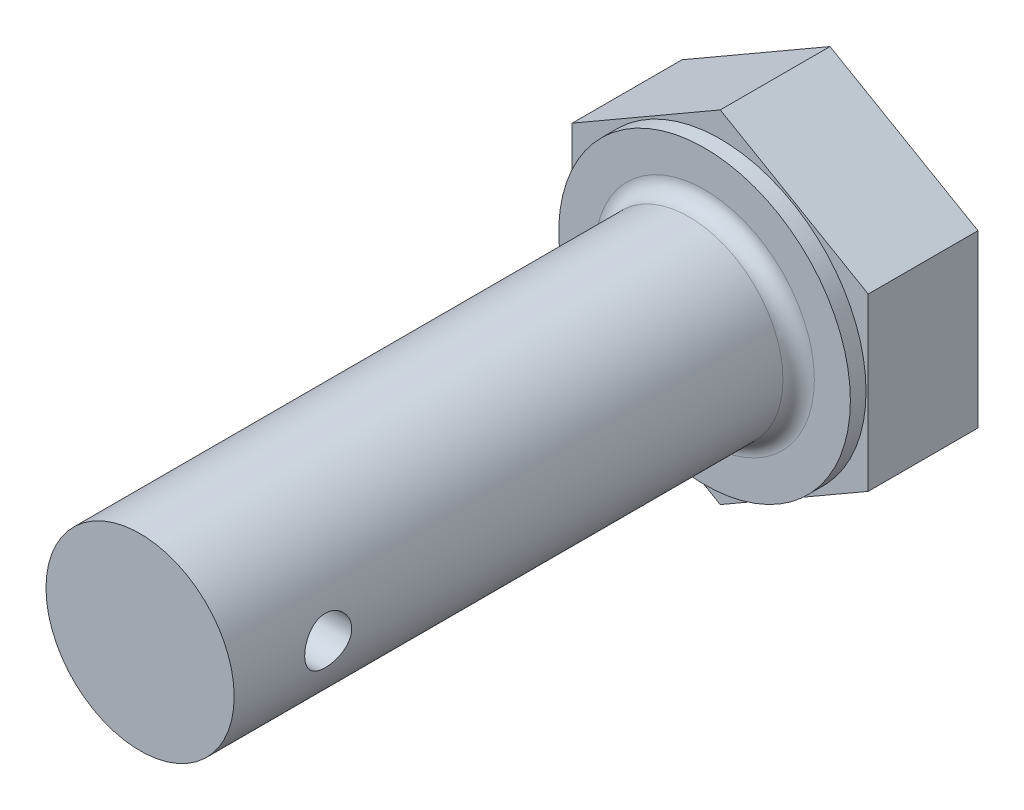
ISO-10303-21;
HEADER;
FILE_DESCRIPTION(('STEP AP214'),'2;1');
FILE_NAME('part.step','',(''),(''),'','','');
FILE_SCHEMA(('AUTOMOTIVE_DESIGN { 1 0 10303 214 1 1 1 1 }'));
ENDSEC;
DATA;
#1=APPLICATION_CONTEXT('core data for automotive mechanical design processes');
#2=APPLICATION_PROTOCOL_DEFINITION('international standard','automotive_design',2000,#1);
#3=PRODUCT_CONTEXT('',#1,'mechanical');
#4=PRODUCT('Part','Part','',(#3));
#5=PRODUCT_RELATED_PRODUCT_CATEGORY('part','',(#4));
#6=PRODUCT_DEFINITION_FORMATION('','',#4);
#7=PRODUCT_DEFINITION_CONTEXT('part definition',#1,'design');
#8=PRODUCT_DEFINITION('design','',#6,#7);
#9=PRODUCT_DEFINITION_SHAPE('','',#8);
#10=(LENGTH_UNIT() NAMED_UNIT(*) SI_UNIT(.MILLI.,.METRE.));
#11=(NAMED_UNIT(*) PLANE_ANGLE_UNIT() SI_UNIT($,.RADIAN.));
#12=(NAMED_UNIT(*) SI_UNIT($,.STERADIAN.) SOLID_ANGLE_UNIT());
#13=UNCERTAINTY_MEASURE_WITH_UNIT(LENGTH_MEASURE(1.E-05),#10,'distance_accuracy_value','');
#14=(GEOMETRIC_REPRESENTATION_CONTEXT(3) GLOBAL_UNCERTAINTY_ASSIGNED_CONTEXT((#13)) GLOBAL_UNIT_ASSIGNED_CONTEXT((#10,
#11,#12)) REPRESENTATION_CONTEXT('',''));
#15=CARTESIAN_POINT('',(0.,0.,0.));
#16=DIRECTION('',(0.,0.,1.));
#17=DIRECTION('',(1.,0.,0.));
#18=AXIS2_PLACEMENT_3D('',#15,#16,#17);
#19=CARTESIAN_POINT('',(-26.2234104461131,0.,4.));
#20=DIRECTION('',(0.,0.,1.));
#21=DIRECTION('',(1.,0.,0.));
#22=AXIS2_PLACEMENT_3D('',#19,#20,#21);
#23=PLANE('',#22);
#24=CARTESIAN_POINT('',(-26.2234104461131,0.,4.));
#25=DIRECTION('',(0.,0.,1.));
#26=DIRECTION('',(1.,0.,0.));
#27=AXIS2_PLACEMENT_3D('',#24,#25,#26);
#28=CIRCLE('',#27,3.5);
#29=CARTESIAN_POINT('',(-22.7234104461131,0.,4.));
#30=VERTEX_POINT('',#29);
#31=EDGE_CURVE('E11',#30,#30,#28,.F.);
#32=ORIENTED_EDGE('',*,*,#31,.T.);
#33=EDGE_LOOP('',(#32));
#34=FACE_BOUND('',#33,.T.);
#35=CARTESIAN_POINT('',(-26.2234104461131,0.,4.));
#36=DIRECTION('',(0.,0.,1.));
#37=DIRECTION('',(1.,0.,0.));
#38=AXIS2_PLACEMENT_3D('',#35,#36,#37);
#39=CIRCLE('',#38,4.65);
#40=CARTESIAN_POINT('',(-21.5734104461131,0.,4.));
#41=VERTEX_POINT('',#40);
#42=EDGE_CURVE('E124',#41,#41,#39,.T.);
#43=ORIENTED_EDGE('',*,*,#42,.T.);
#44=EDGE_LOOP('',(#43));
#45=FACE_BOUND('',#44,.T.);
#46=ADVANCED_FACE('F33',(#34,#45),#23,.T.);
#47=CARTESIAN_POINT('',(-26.2234104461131,5.45,3.5));
#48=DIRECTION('',(0.,0.,1.));
#49=DIRECTION('',(1.,0.,0.));
#50=AXIS2_PLACEMENT_3D('',#47,#48,#49);
#51=PLANE('',#50);
#52=DIRECTION('',(-0.866025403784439,0.499999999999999,0.));
#53=VECTOR('',#52,1.);
#54=CARTESIAN_POINT('',(-21.5035719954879,2.72500000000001,3.5));
#55=LINE('',#54,#53);
#56=CARTESIAN_POINT('',(-21.5035719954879,2.72500000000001,3.5));
#57=VERTEX_POINT('',#56);
#58=CARTESIAN_POINT('',(-26.2234104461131,5.45,3.5));
#59=VERTEX_POINT('',#58);
#60=EDGE_CURVE('E131',#57,#59,#55,.T.);
#61=ORIENTED_EDGE('',*,*,#60,.T.);
#62=DIRECTION('',(-0.866025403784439,-0.499999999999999,0.));
#63=VECTOR('',#62,1.);
#64=CARTESIAN_POINT('',(-26.2234104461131,5.45,3.5));
#65=LINE('',#64,#63);
#66=CARTESIAN_POINT('',(-30.9432488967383,2.72500000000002,3.5));
#67=VERTEX_POINT('',#66);
#68=EDGE_CURVE('E88',#59,#67,#65,.T.);
#69=ORIENTED_EDGE('',*,*,#68,.T.);
#70=DIRECTION('',(0.,-1.,0.));
#71=VECTOR('',#70,1.);
#72=CARTESIAN_POINT('',(-30.9432488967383,2.72500000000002,3.5));
#73=LINE('',#72,#71);
#74=CARTESIAN_POINT('',(-30.9432488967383,-2.72499999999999,3.5));
#75=VERTEX_POINT('',#74);
#76=EDGE_CURVE('E102',#67,#75,#73,.T.);
#77=ORIENTED_EDGE('',*,*,#76,.T.);
#78=DIRECTION('',(0.866025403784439,-0.5,0.));
#79=VECTOR('',#78,1.);
#80=CARTESIAN_POINT('',(-30.9432488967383,-2.72499999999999,3.5));
#81=LINE('',#80,#79);
#82=CARTESIAN_POINT('',(-26.2234104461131,-5.44999999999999,3.5));
#83=VERTEX_POINT('',#82);
#84=EDGE_CURVE('E95',#75,#83,#81,.T.);
#85=ORIENTED_EDGE('',*,*,#84,.T.);
#86=DIRECTION('',(0.866025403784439,0.5,0.));
#87=VECTOR('',#86,1.);
#88=CARTESIAN_POINT('',(-26.2234104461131,-5.44999999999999,3.5));
#89=LINE('',#88,#87);
#90=CARTESIAN_POINT('',(-21.5035719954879,-2.72499999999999,3.5));
#91=VERTEX_POINT('',#90);
#92=EDGE_CURVE('E100',#83,#91,#89,.T.);
#93=ORIENTED_EDGE('',*,*,#92,.T.);
#94=DIRECTION('',(0.,1.,0.));
#95=VECTOR('',#94,1.);
#96=CARTESIAN_POINT('',(-21.5035719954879,-2.72499999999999,3.5));
#97=LINE('',#96,#95);
#98=EDGE_CURVE('E50',#91,#57,#97,.T.);
#99=ORIENTED_EDGE('',*,*,#98,.T.);
#100=EDGE_LOOP('',(#61,#69,#77,#85,#93,#99));
#101=FACE_BOUND('',#100,.T.);
#102=CARTESIAN_POINT('',(-26.2234104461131,0.,3.5));
#103=DIRECTION('',(0.,0.,1.));
#104=DIRECTION('',(1.,0.,0.));
#105=AXIS2_PLACEMENT_3D('',#102,#103,#104);
#106=CIRCLE('',#105,4.65);
#107=CARTESIAN_POINT('',(-21.5734104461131,0.,3.5));
#108=VERTEX_POINT('',#107);
#109=EDGE_CURVE('E208',#108,#108,#106,.T.);
#110=ORIENTED_EDGE('',*,*,#109,.F.);
#111=EDGE_LOOP('',(#110));
#112=FACE_BOUND('',#111,.T.);
#113=ADVANCED_FACE('F97',(#101,#112),#51,.T.);
#114=CARTESIAN_POINT('',(-21.5035719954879,2.72500000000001,3.5));
#115=DIRECTION('',(-0.499999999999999,-0.866025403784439,0.));
#116=DIRECTION('',(0.866025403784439,-0.499999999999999,0.));
#117=AXIS2_PLACEMENT_3D('',#114,#115,#116);
#118=PLANE('',#117);
#119=DIRECTION('',(-0.866025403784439,0.499999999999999,0.));
#120=VECTOR('',#119,1.);
#121=CARTESIAN_POINT('',(-21.5035719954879,2.72500000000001,0.));
#122=LINE('',#121,#120);
#123=CARTESIAN_POINT('',(-21.5035719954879,2.72500000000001,0.));
#124=VERTEX_POINT('',#123);
#125=CARTESIAN_POINT('',(-26.2234104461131,5.45,0.));
#126=VERTEX_POINT('',#125);
#127=EDGE_CURVE('E120',#124,#126,#122,.T.);
#128=ORIENTED_EDGE('',*,*,#127,.T.);
#129=DIRECTION('',(0.,0.,-1.));
#130=VECTOR('',#129,1.);
#131=CARTESIAN_POINT('',(-26.2234104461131,5.45,3.5));
#132=LINE('',#131,#130);
#133=EDGE_CURVE('E138',#59,#126,#132,.T.);
#134=ORIENTED_EDGE('',*,*,#133,.F.);
#135=ORIENTED_EDGE('',*,*,#60,.F.);
#136=DIRECTION('',(0.,0.,-1.));
#137=VECTOR('',#136,1.);
#138=CARTESIAN_POINT('',(-21.5035719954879,2.72500000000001,3.5));
#139=LINE('',#138,#137);
#140=EDGE_CURVE('E116',#57,#124,#139,.T.);
#141=ORIENTED_EDGE('',*,*,#140,.T.);
#142=EDGE_LOOP('',(#128,#134,#135,#141));
#143=FACE_BOUND('',#142,.T.);
#144=ADVANCED_FACE('F173',(#143),#118,.F.);
#145=CARTESIAN_POINT('',(-26.2234104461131,5.45,3.5));
#146=DIRECTION('',(0.499999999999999,-0.866025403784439,0.));
#147=DIRECTION('',(0.866025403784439,0.499999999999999,0.));
#148=AXIS2_PLACEMENT_3D('',#145,#146,#147);
#149=PLANE('',#148);
#150=DIRECTION('',(-0.866025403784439,-0.499999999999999,0.));
#151=VECTOR('',#150,1.);
#152=CARTESIAN_POINT('',(-26.2234104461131,5.45,0.));
#153=LINE('',#152,#151);
#154=CARTESIAN_POINT('',(-30.9432488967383,2.72500000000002,0.));
#155=VERTEX_POINT('',#154);
#156=EDGE_CURVE('E123',#126,#155,#153,.T.);
#157=ORIENTED_EDGE('',*,*,#156,.T.);
#158=DIRECTION('',(0.,0.,-1.));
#159=VECTOR('',#158,1.);
#160=CARTESIAN_POINT('',(-30.9432488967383,2.72500000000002,3.5));
#161=LINE('',#160,#159);
#162=EDGE_CURVE('E135',#67,#155,#161,.T.);
#163=ORIENTED_EDGE('',*,*,#162,.F.);
#164=ORIENTED_EDGE('',*,*,#68,.F.);
#165=ORIENTED_EDGE('',*,*,#133,.T.);
#166=EDGE_LOOP('',(#157,#163,#164,#165));
#167=FACE_BOUND('',#166,.T.);
#168=ADVANCED_FACE('F194',(#167),#149,.F.);
#169=CARTESIAN_POINT('',(-30.9432488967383,2.72500000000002,3.5));
#170=DIRECTION('',(1.,0.,0.));
#171=DIRECTION('',(0.,0.,-1.));
#172=AXIS2_PLACEMENT_3D('',#169,#170,#171);
#173=PLANE('',#172);
#174=DIRECTION('',(0.,-1.,0.));
#175=VECTOR('',#174,1.);
#176=CARTESIAN_POINT('',(-30.9432488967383,2.72500000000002,0.));
#177=LINE('',#176,#175);
#178=CARTESIAN_POINT('',(-30.9432488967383,-2.72499999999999,0.));
#179=VERTEX_POINT('',#178);
#180=EDGE_CURVE('E126',#155,#179,#177,.T.);
#181=ORIENTED_EDGE('',*,*,#180,.T.);
#182=DIRECTION('',(0.,0.,-1.));
#183=VECTOR('',#182,1.);
#184=CARTESIAN_POINT('',(-30.9432488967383,-2.72499999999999,3.5));
#185=LINE('',#184,#183);
#186=EDGE_CURVE('E111',#75,#179,#185,.T.);
#187=ORIENTED_EDGE('',*,*,#186,.F.);
#188=ORIENTED_EDGE('',*,*,#76,.F.);
#189=ORIENTED_EDGE('',*,*,#162,.T.);
#190=EDGE_LOOP('',(#181,#187,#188,#189));
#191=FACE_BOUND('',#190,.T.);
#192=ADVANCED_FACE('F191',(#191),#173,.F.);
#193=CARTESIAN_POINT('',(-30.9432488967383,-2.72499999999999,3.5));
#194=DIRECTION('',(0.5,0.866025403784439,0.));
#195=DIRECTION('',(-0.866025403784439,0.5,0.));
#196=AXIS2_PLACEMENT_3D('',#193,#194,#195);
#197=PLANE('',#196);
#198=DIRECTION('',(0.866025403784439,-0.5,0.));
#199=VECTOR('',#198,1.);
#200=CARTESIAN_POINT('',(-30.9432488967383,-2.72499999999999,0.));
#201=LINE('',#200,#199);
#202=CARTESIAN_POINT('',(-26.2234104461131,-5.44999999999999,0.));
#203=VERTEX_POINT('',#202);
#204=EDGE_CURVE('E110',#179,#203,#201,.T.);
#205=ORIENTED_EDGE('',*,*,#204,.T.);
#206=DIRECTION('',(0.,0.,-1.));
#207=VECTOR('',#206,1.);
#208=CARTESIAN_POINT('',(-26.2234104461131,-5.44999999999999,3.5));
#209=LINE('',#208,#207);
#210=EDGE_CURVE('E107',#83,#203,#209,.T.);
#211=ORIENTED_EDGE('',*,*,#210,.F.);
#212=ORIENTED_EDGE('',*,*,#84,.F.);
#213=ORIENTED_EDGE('',*,*,#186,.T.);
#214=EDGE_LOOP('',(#205,#211,#212,#213));
#215=FACE_BOUND('',#214,.T.);
#216=ADVANCED_FACE('F108',(#215),#197,.F.);
#217=CARTESIAN_POINT('',(-26.2234104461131,-5.44999999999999,3.5));
#218=DIRECTION('',(-0.5,0.866025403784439,0.));
#219=DIRECTION('',(-0.866025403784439,-0.5,0.));
#220=AXIS2_PLACEMENT_3D('',#217,#218,#219);
#221=PLANE('',#220);
#222=DIRECTION('',(0.866025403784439,0.5,0.));
#223=VECTOR('',#222,1.);
#224=CARTESIAN_POINT('',(-26.2234104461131,-5.44999999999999,0.));
#225=LINE('',#224,#223);
#226=CARTESIAN_POINT('',(-21.5035719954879,-2.72499999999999,0.));
#227=VERTEX_POINT('',#226);
#228=EDGE_CURVE('E73',#203,#227,#225,.T.);
#229=ORIENTED_EDGE('',*,*,#228,.T.);
#230=DIRECTION('',(0.,0.,-1.));
#231=VECTOR('',#230,1.);
#232=CARTESIAN_POINT('',(-21.5035719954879,-2.72499999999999,3.5));
#233=LINE('',#232,#231);
#234=EDGE_CURVE('E112',#91,#227,#233,.T.);
#235=ORIENTED_EDGE('',*,*,#234,.F.);
#236=ORIENTED_EDGE('',*,*,#92,.F.);
#237=ORIENTED_EDGE('',*,*,#210,.T.);
#238=EDGE_LOOP('',(#229,#235,#236,#237));
#239=FACE_BOUND('',#238,.T.);
#240=ADVANCED_FACE('F114',(#239),#221,.F.);
#241=CARTESIAN_POINT('',(-21.5035719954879,-2.72499999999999,3.5));
#242=DIRECTION('',(-1.,0.,0.));
#243=DIRECTION('',(0.,-1.,0.));
#244=AXIS2_PLACEMENT_3D('',#241,#242,#243);
#245=PLANE('',#244);
#246=DIRECTION('',(0.,1.,0.));
#247=VECTOR('',#246,1.);
#248=CARTESIAN_POINT('',(-21.5035719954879,-2.72499999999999,0.));
#249=LINE('',#248,#247);
#250=EDGE_CURVE('E79',#227,#124,#249,.T.);
#251=ORIENTED_EDGE('',*,*,#250,.T.);
#252=ORIENTED_EDGE('',*,*,#140,.F.);
#253=ORIENTED_EDGE('',*,*,#98,.F.);
#254=ORIENTED_EDGE('',*,*,#234,.T.);
#255=EDGE_LOOP('',(#251,#252,#253,#254));
#256=FACE_BOUND('',#255,.T.);
#257=ADVANCED_FACE('F183',(#256),#245,.F.);
#258=CARTESIAN_POINT('',(-26.2234104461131,5.45,0.));
#259=DIRECTION('',(0.,0.,1.));
#260=DIRECTION('',(1.,0.,0.));
#261=AXIS2_PLACEMENT_3D('',#258,#259,#260);
#262=PLANE('',#261);
#263=ORIENTED_EDGE('',*,*,#127,.F.);
#264=ORIENTED_EDGE('',*,*,#250,.F.);
#265=ORIENTED_EDGE('',*,*,#228,.F.);
#266=ORIENTED_EDGE('',*,*,#204,.F.);
#267=ORIENTED_EDGE('',*,*,#180,.F.);
#268=ORIENTED_EDGE('',*,*,#156,.F.);
#269=EDGE_LOOP('',(#263,#264,#265,#266,#267,#268));
#270=FACE_BOUND('',#269,.T.);
#271=ADVANCED_FACE('F178',(#270),#262,.F.);
#272=CARTESIAN_POINT('',(-26.2234104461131,0.,4.));
#273=DIRECTION('',(0.,0.,-1.));
#274=DIRECTION('',(-1.,0.,0.));
#275=AXIS2_PLACEMENT_3D('',#272,#273,#274);
#276=CYLINDRICAL_SURFACE('',#275,4.65);
#277=ORIENTED_EDGE('',*,*,#42,.F.);
#278=EDGE_LOOP('',(#277));
#279=FACE_BOUND('',#278,.T.);
#280=ORIENTED_EDGE('',*,*,#109,.T.);
#281=EDGE_LOOP('',(#280));
#282=FACE_BOUND('',#281,.T.);
#283=ADVANCED_FACE('F165',(#279,#282),#276,.T.);
#284=CARTESIAN_POINT('',(-26.2234104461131,0.,22.));
#285=DIRECTION('',(0.,0.,-1.));
#286=DIRECTION('',(-1.,0.,0.));
#287=AXIS2_PLACEMENT_3D('',#284,#285,#286);
#288=CYLINDRICAL_SURFACE('',#287,3.);
#289=CARTESIAN_POINT('',(-26.2234104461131,0.,4.5));
#290=DIRECTION('',(0.,0.,1.));
#291=DIRECTION('',(1.,0.,0.));
#292=AXIS2_PLACEMENT_3D('',#289,#290,#291);
#293=CIRCLE('',#292,3.);
#294=CARTESIAN_POINT('',(-23.2234104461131,0.,4.5));
#295=VERTEX_POINT('',#294);
#296=EDGE_CURVE('E42',#295,#295,#293,.T.);
#297=ORIENTED_EDGE('',*,*,#296,.T.);
#298=EDGE_LOOP('',(#297));
#299=FACE_BOUND('',#298,.T.);
#300=CARTESIAN_POINT('',(-29.2234104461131,0.,19.75));
#301=CARTESIAN_POINT('',(-29.2234097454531,-0.041438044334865,19.7499988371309));
#302=CARTESIAN_POINT('',(-29.2225433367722,-0.0828890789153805,19.7465542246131));
#303=CARTESIAN_POINT('',(-29.2191710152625,-0.164603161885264,19.7328874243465));
#304=CARTESIAN_POINT('',(-29.2166641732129,-0.204865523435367,19.7226613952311));
#305=CARTESIAN_POINT('',(-29.2102885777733,-0.283010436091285,19.6957803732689));
#306=CARTESIAN_POINT('',(-29.2064214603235,-0.320895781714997,19.6791331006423));
#307=CARTESIAN_POINT('',(-29.197737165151,-0.393336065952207,19.6399093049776));
#308=CARTESIAN_POINT('',(-29.1929199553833,-0.427890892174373,19.6173325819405));
#309=CARTESIAN_POINT('',(-29.1827475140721,-0.493400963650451,19.5663996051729));
#310=CARTESIAN_POINT('',(-29.1773839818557,-0.524277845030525,19.5379442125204));
#311=CARTESIAN_POINT('',(-29.1667785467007,-0.580874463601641,19.4762738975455));
#312=CARTESIAN_POINT('',(-29.1615366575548,-0.606593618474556,19.4430584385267));
#313=CARTESIAN_POINT('',(-29.1516843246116,-0.652513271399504,19.3722023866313));
#314=CARTESIAN_POINT('',(-29.1470844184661,-0.672626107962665,19.3345033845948));
#315=CARTESIAN_POINT('',(-29.1391579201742,-0.706198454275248,19.2561257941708));
#316=CARTESIAN_POINT('',(-29.135831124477,-0.71965902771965,19.2154476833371));
#317=CARTESIAN_POINT('',(-29.1309128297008,-0.739277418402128,19.1331282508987));
#318=CARTESIAN_POINT('',(-29.1292879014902,-0.745576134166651,19.0915225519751));
#319=CARTESIAN_POINT('',(-29.1278572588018,-0.751130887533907,19.007815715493));
#320=CARTESIAN_POINT('',(-29.1280512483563,-0.750388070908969,18.9657146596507));
#321=CARTESIAN_POINT('',(-29.1302064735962,-0.74199326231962,18.8832920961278));
#322=CARTESIAN_POINT('',(-29.1321247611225,-0.734509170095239,18.8429521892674));
#323=CARTESIAN_POINT('',(-29.1374439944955,-0.713112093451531,18.7641194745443));
#324=CARTESIAN_POINT('',(-29.1408450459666,-0.699198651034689,18.7256267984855));
#325=CARTESIAN_POINT('',(-29.148786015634,-0.665194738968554,18.651130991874));
#326=CARTESIAN_POINT('',(-29.1533370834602,-0.645043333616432,18.6151569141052));
#327=CARTESIAN_POINT('',(-29.163059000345,-0.599178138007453,18.5470406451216));
#328=CARTESIAN_POINT('',(-29.1682299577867,-0.573463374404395,18.5148991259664));
#329=CARTESIAN_POINT('',(-29.178789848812,-0.516331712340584,18.4543981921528));
#330=CARTESIAN_POINT('',(-29.1841807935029,-0.484773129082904,18.4261727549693));
#331=CARTESIAN_POINT('',(-29.194440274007,-0.417305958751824,18.375389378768));
#332=CARTESIAN_POINT('',(-29.1993087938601,-0.381397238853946,18.3528316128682));
#333=CARTESIAN_POINT('',(-29.207999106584,-0.306057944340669,18.3139747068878));
#334=CARTESIAN_POINT('',(-29.2118172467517,-0.266615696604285,18.2976973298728));
#335=CARTESIAN_POINT('',(-29.2179500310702,-0.185438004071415,18.2720413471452));
#336=CARTESIAN_POINT('',(-29.2202649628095,-0.143702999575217,18.2626614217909));
#337=CARTESIAN_POINT('',(-29.2230879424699,-0.0602699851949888,18.2512712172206));
#338=CARTESIAN_POINT('',(-29.2236407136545,-0.0185983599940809,18.2490784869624));
#339=CARTESIAN_POINT('',(-29.2230044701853,0.0645164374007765,18.2516245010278));
#340=CARTESIAN_POINT('',(-29.2218156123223,0.105959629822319,18.2563626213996));
#341=CARTESIAN_POINT('',(-29.2178583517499,0.186807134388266,18.2724854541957));
#342=CARTESIAN_POINT('',(-29.2151136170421,0.226232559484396,18.2837706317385));
#343=CARTESIAN_POINT('',(-29.2083539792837,0.302628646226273,18.3125535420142));
#344=CARTESIAN_POINT('',(-29.2043389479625,0.339599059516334,18.3300519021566));
#345=CARTESIAN_POINT('',(-29.1953769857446,0.41076156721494,18.3711180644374));
#346=CARTESIAN_POINT('',(-29.1904147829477,0.444892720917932,18.3947880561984));
#347=CARTESIAN_POINT('',(-29.1801329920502,0.508763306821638,18.4473949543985));
#348=CARTESIAN_POINT('',(-29.1748133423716,0.538501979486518,18.4763327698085));
#349=CARTESIAN_POINT('',(-29.1642552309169,0.593495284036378,18.5395009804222));
#350=CARTESIAN_POINT('',(-29.1590219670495,0.618621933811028,18.5738438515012));
#351=CARTESIAN_POINT('',(-29.1493748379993,0.66275537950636,18.6463663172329));
#352=CARTESIAN_POINT('',(-29.1449609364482,0.681762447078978,18.6845457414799));
#353=CARTESIAN_POINT('',(-29.1375009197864,0.712975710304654,18.7634528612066));
#354=CARTESIAN_POINT('',(-29.1344467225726,0.72522219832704,18.804163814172));
#355=CARTESIAN_POINT('',(-29.130044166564,0.742672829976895,18.8871548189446));
#356=CARTESIAN_POINT('',(-29.1286954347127,0.747878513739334,18.9294345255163));
#357=CARTESIAN_POINT('',(-29.1278849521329,0.751019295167,19.0130605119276));
#358=CARTESIAN_POINT('',(-29.1283701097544,0.749158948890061,19.0543987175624));
#359=CARTESIAN_POINT('',(-29.1310499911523,0.738688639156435,19.136151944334));
#360=CARTESIAN_POINT('',(-29.1332446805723,0.730078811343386,19.1765669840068));
#361=CARTESIAN_POINT('',(-29.1390667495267,0.706465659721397,19.2551042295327));
#362=CARTESIAN_POINT('',(-29.1426855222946,0.691500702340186,19.2932386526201));
#363=CARTESIAN_POINT('',(-29.1509492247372,0.655632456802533,19.3664826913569));
#364=CARTESIAN_POINT('',(-29.1555942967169,0.634728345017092,19.4015918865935));
#365=CARTESIAN_POINT('',(-29.1655386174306,0.586933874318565,19.468777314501));
#366=CARTESIAN_POINT('',(-29.1708517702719,0.559901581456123,19.500750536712));
#367=CARTESIAN_POINT('',(-29.1814505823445,0.500894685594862,19.5597735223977));
#368=CARTESIAN_POINT('',(-29.1867362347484,0.468918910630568,19.5868221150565));
#369=CARTESIAN_POINT('',(-29.1967987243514,0.400233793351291,19.6357056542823));
#370=CARTESIAN_POINT('',(-29.2015646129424,0.36344921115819,19.6574373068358));
#371=CARTESIAN_POINT('',(-29.2099350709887,0.286633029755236,19.6943737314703));
#372=CARTESIAN_POINT('',(-29.213540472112,0.246603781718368,19.7095831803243));
#373=CARTESIAN_POINT('',(-29.2186507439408,0.172205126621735,19.7307859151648));
#374=CARTESIAN_POINT('',(-29.2204233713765,0.138190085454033,19.7379756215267));
#375=CARTESIAN_POINT('',(-29.2228034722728,0.069453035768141,19.747582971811));
#376=CARTESIAN_POINT('',(-29.2234110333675,0.0347310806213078,19.7500009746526));
#377=CARTESIAN_POINT('',(-29.2234104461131,0.,19.75));
#378=B_SPLINE_CURVE_WITH_KNOTS('',3,(#300,#301,#302,#303,#304,#305,#306,#307,#308,#309,#310,
#311,#312,#313,#314,#315,#316,#317,#318,#319,#320,#321,#322,#323,#324,#325,#326,#327,#328,#329,
#330,#331,#332,#333,#334,#335,#336,#337,#338,#339,#340,#341,#342,#343,#344,#345,#346,#347,#348,
#349,#350,#351,#352,#353,#354,#355,#356,#357,#358,#359,#360,#361,#362,#363,#364,#365,#366,#367,
#368,#369,#370,#371,#372,#373,#374,#375,#376,#377),.UNSPECIFIED.,.T.,.F.,(4,2,2,2,2,2,2,2,2,2,2,
2,2,2,2,2,2,2,2,2,2,2,2,2,2,2,2,2,2,2,2,2,2,2,2,2,2,2,4),(0.,0.124186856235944,
0.248444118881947,0.372552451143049,0.496664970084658,0.623072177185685,0.749493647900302,
0.877793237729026,1.00607230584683,1.13178147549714,1.25747019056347,1.38011248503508,
1.50276351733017,1.62665263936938,1.75056345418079,1.87800750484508,2.00545544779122,
2.13334114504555,2.26120236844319,2.38579154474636,2.51036950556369,2.63310137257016,
2.75584563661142,2.88076793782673,3.00571181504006,3.13372254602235,3.26172759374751,
3.38896127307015,3.516167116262,3.63971890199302,3.76326820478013,3.88608200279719,
4.00891284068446,4.13494788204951,4.26101284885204,4.38936092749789,4.5176168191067,
4.62171121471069,4.72579778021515),.UNSPECIFIED.);
#379=CARTESIAN_POINT('',(-29.2234104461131,0.,19.75));
#380=VERTEX_POINT('',#379);
#381=EDGE_CURVE('E147',#380,#380,#378,.T.);
#382=ORIENTED_EDGE('',*,*,#381,.T.);
#383=EDGE_LOOP('',(#382));
#384=FACE_BOUND('',#383,.T.);
#385=CARTESIAN_POINT('',(-23.2234104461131,0.,18.25));
#386=CARTESIAN_POINT('',(-23.223411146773,-0.0414380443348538,18.2500011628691));
#387=CARTESIAN_POINT('',(-23.2242775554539,-0.0828890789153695,18.2534457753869));
#388=CARTESIAN_POINT('',(-23.2276498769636,-0.164603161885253,18.2671125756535));
#389=CARTESIAN_POINT('',(-23.2301567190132,-0.204865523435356,18.2773386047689));
#390=CARTESIAN_POINT('',(-23.2365323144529,-0.283010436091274,18.304219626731));
#391=CARTESIAN_POINT('',(-23.2403994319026,-0.320895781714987,18.3208668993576));
#392=CARTESIAN_POINT('',(-23.2490837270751,-0.393336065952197,18.3600906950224));
#393=CARTESIAN_POINT('',(-23.2539009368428,-0.427890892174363,18.3826674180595));
#394=CARTESIAN_POINT('',(-23.2640733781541,-0.493400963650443,18.4336003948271));
#395=CARTESIAN_POINT('',(-23.2694369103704,-0.524277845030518,18.4620557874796));
#396=CARTESIAN_POINT('',(-23.2800423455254,-0.580874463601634,18.5237261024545));
#397=CARTESIAN_POINT('',(-23.2852842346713,-0.606593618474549,18.5569415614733));
#398=CARTESIAN_POINT('',(-23.2951365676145,-0.652513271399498,18.6277976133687));
#399=CARTESIAN_POINT('',(-23.29973647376,-0.67262610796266,18.6654966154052));
#400=CARTESIAN_POINT('',(-23.307662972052,-0.706198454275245,18.7438742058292));
#401=CARTESIAN_POINT('',(-23.3109897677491,-0.719659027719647,18.7845523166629));
#402=CARTESIAN_POINT('',(-23.3159080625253,-0.739277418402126,18.8668717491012));
#403=CARTESIAN_POINT('',(-23.3175329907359,-0.74557613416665,18.9084774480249));
#404=CARTESIAN_POINT('',(-23.3189636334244,-0.751130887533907,18.992184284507));
#405=CARTESIAN_POINT('',(-23.3187696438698,-0.75038807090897,19.0342853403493));
#406=CARTESIAN_POINT('',(-23.31661441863,-0.741993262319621,19.1167079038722));
#407=CARTESIAN_POINT('',(-23.3146961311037,-0.734509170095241,19.1570478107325));
#408=CARTESIAN_POINT('',(-23.3093768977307,-0.713112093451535,19.2358805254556));
#409=CARTESIAN_POINT('',(-23.3059758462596,-0.699198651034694,19.2743732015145));
#410=CARTESIAN_POINT('',(-23.2980348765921,-0.665194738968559,19.348869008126));
#411=CARTESIAN_POINT('',(-23.293483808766,-0.645043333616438,19.3848430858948));
#412=CARTESIAN_POINT('',(-23.2837618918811,-0.599178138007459,19.4529593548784));
#413=CARTESIAN_POINT('',(-23.2785909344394,-0.573463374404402,19.4851008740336));
#414=CARTESIAN_POINT('',(-23.2680310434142,-0.516331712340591,19.5456018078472));
#415=CARTESIAN_POINT('',(-23.2626400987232,-0.484773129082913,19.5738272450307));
#416=CARTESIAN_POINT('',(-23.2523806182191,-0.417305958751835,19.6246106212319));
#417=CARTESIAN_POINT('',(-23.247512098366,-0.381397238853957,19.6471683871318));
#418=CARTESIAN_POINT('',(-23.2388217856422,-0.306057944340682,19.6860252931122));
#419=CARTESIAN_POINT('',(-23.2350036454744,-0.266615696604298,19.7023026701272));
#420=CARTESIAN_POINT('',(-23.228870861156,-0.185438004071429,19.7279586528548));
#421=CARTESIAN_POINT('',(-23.2265559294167,-0.14370299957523,19.7373385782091));
#422=CARTESIAN_POINT('',(-23.2237329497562,-0.0602699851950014,19.7487287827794));
#423=CARTESIAN_POINT('',(-23.2231801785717,-0.0185983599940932,19.7509215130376));
#424=CARTESIAN_POINT('',(-23.2238164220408,0.0645164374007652,19.7483754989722));
#425=CARTESIAN_POINT('',(-23.2250052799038,0.105959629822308,19.7436373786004));
#426=CARTESIAN_POINT('',(-23.2289625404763,0.186807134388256,19.7275145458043));
#427=CARTESIAN_POINT('',(-23.231707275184,0.226232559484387,19.7162293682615));
#428=CARTESIAN_POINT('',(-23.2384669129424,0.302628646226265,19.6874464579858));
#429=CARTESIAN_POINT('',(-23.2424819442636,0.339599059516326,19.6699480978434));
#430=CARTESIAN_POINT('',(-23.2514439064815,0.410761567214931,19.6288819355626));
#431=CARTESIAN_POINT('',(-23.2564061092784,0.444892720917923,19.6052119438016));
#432=CARTESIAN_POINT('',(-23.266687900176,0.508763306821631,19.5526050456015));
#433=CARTESIAN_POINT('',(-23.2720075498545,0.53850197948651,19.5236672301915));
#434=CARTESIAN_POINT('',(-23.2825656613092,0.593495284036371,19.4604990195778));
#435=CARTESIAN_POINT('',(-23.2877989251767,0.618621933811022,19.4261561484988));
#436=CARTESIAN_POINT('',(-23.2974460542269,0.662755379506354,19.3536336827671));
#437=CARTESIAN_POINT('',(-23.3018599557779,0.681762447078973,19.3154542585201));
#438=CARTESIAN_POINT('',(-23.3093199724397,0.71297571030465,19.2365471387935));
#439=CARTESIAN_POINT('',(-23.3123741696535,0.725222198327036,19.195836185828));
#440=CARTESIAN_POINT('',(-23.3167767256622,0.742672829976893,19.1128451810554));
#441=CARTESIAN_POINT('',(-23.3181254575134,0.747878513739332,19.0705654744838));
#442=CARTESIAN_POINT('',(-23.3189359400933,0.751019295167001,18.9869394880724));
#443=CARTESIAN_POINT('',(-23.3184507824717,0.749158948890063,18.9456012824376));
#444=CARTESIAN_POINT('',(-23.3157709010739,0.738688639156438,18.863848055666));
#445=CARTESIAN_POINT('',(-23.3135762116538,0.730078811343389,18.8234330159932));
#446=CARTESIAN_POINT('',(-23.3077541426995,0.706465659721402,18.7448957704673));
#447=CARTESIAN_POINT('',(-23.3041353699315,0.691500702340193,18.7067613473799));
#448=CARTESIAN_POINT('',(-23.2958716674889,0.655632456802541,18.6335173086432));
#449=CARTESIAN_POINT('',(-23.2912265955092,0.634728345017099,18.5984081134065));
#450=CARTESIAN_POINT('',(-23.2812822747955,0.586933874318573,18.531222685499));
#451=CARTESIAN_POINT('',(-23.2759691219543,0.559901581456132,18.499249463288));
#452=CARTESIAN_POINT('',(-23.2653703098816,0.500894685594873,18.4402264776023));
#453=CARTESIAN_POINT('',(-23.2600846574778,0.468918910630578,18.4131778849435));
#454=CARTESIAN_POINT('',(-23.2500221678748,0.4002337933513,18.3642943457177));
#455=CARTESIAN_POINT('',(-23.2452562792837,0.3634492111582,18.3425626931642));
#456=CARTESIAN_POINT('',(-23.2368858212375,0.286633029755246,18.3056262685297));
#457=CARTESIAN_POINT('',(-23.2332804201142,0.246603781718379,18.2904168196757));
#458=CARTESIAN_POINT('',(-23.2281701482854,0.172205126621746,18.2692140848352));
#459=CARTESIAN_POINT('',(-23.2263975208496,0.138190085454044,18.2620243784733));
#460=CARTESIAN_POINT('',(-23.2240174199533,0.0694530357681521,18.252417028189));
#461=CARTESIAN_POINT('',(-23.2234098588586,0.0347310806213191,18.2499990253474));
#462=CARTESIAN_POINT('',(-23.2234104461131,0.,18.25));
#463=B_SPLINE_CURVE_WITH_KNOTS('',3,(#385,#386,#387,#388,#389,#390,#391,#392,#393,#394,#395,
#396,#397,#398,#399,#400,#401,#402,#403,#404,#405,#406,#407,#408,#409,#410,#411,#412,#413,#414,
#415,#416,#417,#418,#419,#420,#421,#422,#423,#424,#425,#426,#427,#428,#429,#430,#431,#432,#433,
#434,#435,#436,#437,#438,#439,#440,#441,#442,#443,#444,#445,#446,#447,#448,#449,#450,#451,#452,
#453,#454,#455,#456,#457,#458,#459,#460,#461,#462),.UNSPECIFIED.,.T.,.F.,(4,2,2,2,2,2,2,2,2,2,2,
2,2,2,2,2,2,2,2,2,2,2,2,2,2,2,2,2,2,2,2,2,2,2,2,2,2,2,4),(0.,0.124186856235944,
0.248444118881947,0.372552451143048,0.496664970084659,0.623072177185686,0.749493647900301,
0.877793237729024,1.00607230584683,1.13178147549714,1.25747019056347,1.38011248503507,
1.50276351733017,1.62665263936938,1.7505634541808,1.87800750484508,2.00545544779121,
2.13334114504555,2.26120236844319,2.38579154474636,2.51036950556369,2.63310137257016,
2.75584563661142,2.88076793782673,3.00571181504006,3.13372254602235,3.26172759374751,
3.38896127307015,3.516167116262,3.63971890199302,3.76326820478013,3.88608200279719,
4.00891284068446,4.13494788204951,4.26101284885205,4.3893609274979,4.5176168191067,
4.6217112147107,4.72579778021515),.UNSPECIFIED.);
#464=CARTESIAN_POINT('',(-23.2234104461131,0.,18.25));
#465=VERTEX_POINT('',#464);
#466=EDGE_CURVE('E140',#465,#465,#463,.T.);
#467=ORIENTED_EDGE('',*,*,#466,.T.);
#468=EDGE_LOOP('',(#467));
#469=FACE_BOUND('',#468,.T.);
#470=CARTESIAN_POINT('',(-26.2234104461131,0.,22.));
#471=DIRECTION('',(0.,0.,1.));
#472=DIRECTION('',(1.,0.,0.));
#473=AXIS2_PLACEMENT_3D('',#470,#471,#472);
#474=CIRCLE('',#473,3.);
#475=CARTESIAN_POINT('',(-23.2234104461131,0.,22.));
#476=VERTEX_POINT('',#475);
#477=EDGE_CURVE('E211',#476,#476,#474,.T.);
#478=ORIENTED_EDGE('',*,*,#477,.F.);
#479=EDGE_LOOP('',(#478));
#480=FACE_BOUND('',#479,.T.);
#481=ADVANCED_FACE('F150',(#299,#384,#469,#480),#288,.T.);
#482=CARTESIAN_POINT('',(-26.2234104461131,0.,22.));
#483=DIRECTION('',(0.,0.,1.));
#484=DIRECTION('',(1.,0.,0.));
#485=AXIS2_PLACEMENT_3D('',#482,#483,#484);
#486=PLANE('',#485);
#487=ORIENTED_EDGE('',*,*,#477,.T.);
#488=EDGE_LOOP('',(#487));
#489=FACE_BOUND('',#488,.T.);
#490=ADVANCED_FACE('F157',(#489),#486,.T.);
#491=CARTESIAN_POINT('',(-21.5035719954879,0.,19.));
#492=DIRECTION('',(1.,0.,0.));
#493=DIRECTION('',(0.,0.,-1.));
#494=AXIS2_PLACEMENT_3D('',#491,#492,#493);
#495=CYLINDRICAL_SURFACE('',#494,0.749999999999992);
#496=ORIENTED_EDGE('',*,*,#466,.F.);
#497=EDGE_LOOP('',(#496));
#498=FACE_BOUND('',#497,.T.);
#499=ORIENTED_EDGE('',*,*,#381,.F.);
#500=EDGE_LOOP('',(#499));
#501=FACE_BOUND('',#500,.T.);
#502=ADVANCED_FACE('F154',(#498,#501),#495,.F.);
#503=CARTESIAN_POINT('',(-26.2234104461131,0.,4.5));
#504=DIRECTION('',(0.,0.,1.));
#505=DIRECTION('',(1.,0.,0.));
#506=AXIS2_PLACEMENT_3D('',#503,#504,#505);
#507=TOROIDAL_SURFACE('',#506,3.5,0.5);
#508=ORIENTED_EDGE('',*,*,#31,.F.);
#509=EDGE_LOOP('',(#508));
#510=FACE_BOUND('',#509,.T.);
#511=ORIENTED_EDGE('',*,*,#296,.F.);
#512=EDGE_LOOP('',(#511));
#513=FACE_BOUND('',#512,.T.);
#514=ADVANCED_FACE('F35',(#510,#513),#507,.F.);
#515=CLOSED_SHELL('',(#46,#113,#144,#168,#192,#216,#240,#257,#271,#283,#481,#490,#502,#514));
#516=MANIFOLD_SOLID_BREP('B2',#515);
#517=ADVANCED_BREP_SHAPE_REPRESENTATION('',(#18,#516),#14);
#518=SHAPE_DEFINITION_REPRESENTATION(#9,#517);
ENDSEC;
END-ISO-10303-21;
